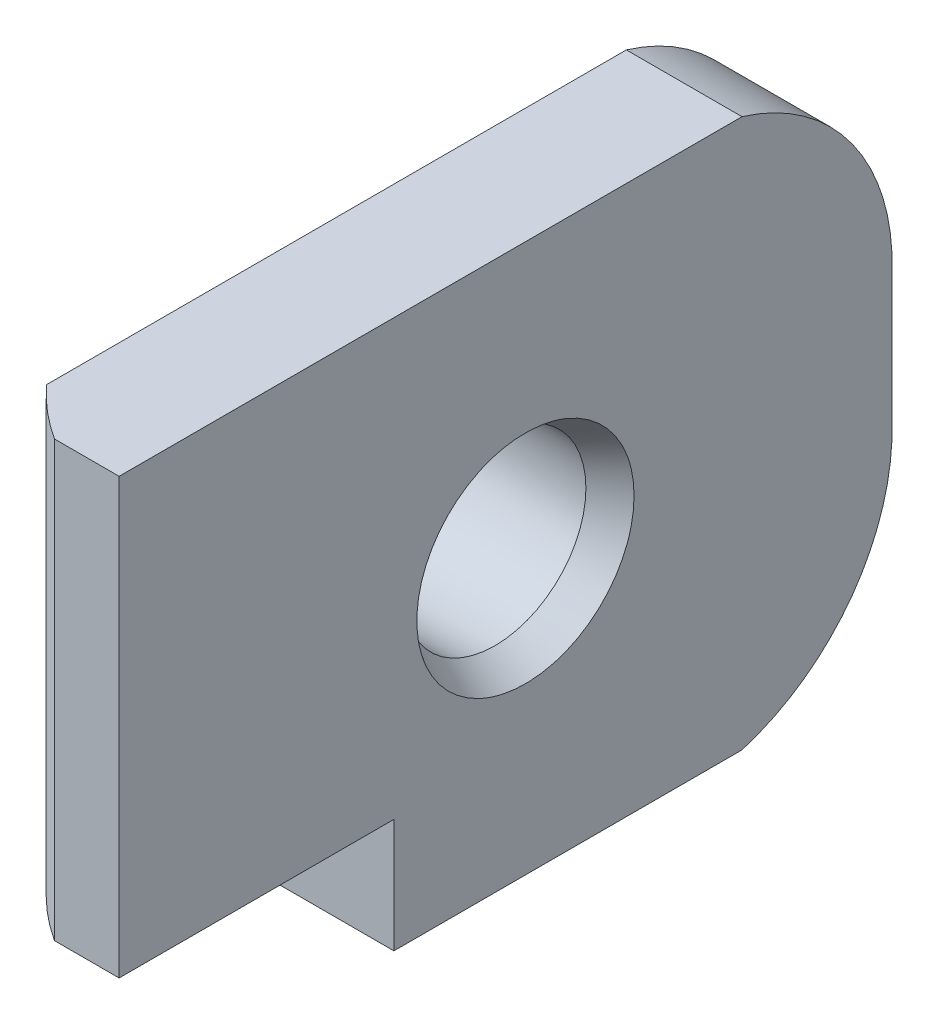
ISO-10303-21;
HEADER;
FILE_DESCRIPTION(('STEP AP214'),'2;1');
FILE_NAME('part.step','',(''),(''),'','','');
FILE_SCHEMA(('AUTOMOTIVE_DESIGN { 1 0 10303 214 1 1 1 1 }'));
ENDSEC;
DATA;
#1=APPLICATION_CONTEXT('core data for automotive mechanical design processes');
#2=APPLICATION_PROTOCOL_DEFINITION('international standard','automotive_design',2000,#1);
#3=PRODUCT_CONTEXT('',#1,'mechanical');
#4=PRODUCT('Part','Part','',(#3));
#5=PRODUCT_RELATED_PRODUCT_CATEGORY('part','',(#4));
#6=PRODUCT_DEFINITION_FORMATION('','',#4);
#7=PRODUCT_DEFINITION_CONTEXT('part definition',#1,'design');
#8=PRODUCT_DEFINITION('design','',#6,#7);
#9=PRODUCT_DEFINITION_SHAPE('','',#8);
#10=(LENGTH_UNIT() NAMED_UNIT(*) SI_UNIT(.MILLI.,.METRE.));
#11=(NAMED_UNIT(*) PLANE_ANGLE_UNIT() SI_UNIT($,.RADIAN.));
#12=(NAMED_UNIT(*) SI_UNIT($,.STERADIAN.) SOLID_ANGLE_UNIT());
#13=UNCERTAINTY_MEASURE_WITH_UNIT(LENGTH_MEASURE(1.E-05),#10,'distance_accuracy_value','');
#14=(GEOMETRIC_REPRESENTATION_CONTEXT(3) GLOBAL_UNCERTAINTY_ASSIGNED_CONTEXT((#13)) GLOBAL_UNIT_ASSIGNED_CONTEXT((#10,
#11,#12)) REPRESENTATION_CONTEXT('',''));
#15=CARTESIAN_POINT('',(0.,0.,0.));
#16=DIRECTION('',(0.,0.,1.));
#17=DIRECTION('',(1.,0.,0.));
#18=AXIS2_PLACEMENT_3D('',#15,#16,#17);
#19=CARTESIAN_POINT('',(-3.4544,9.652,16.7132));
#20=DIRECTION('',(1.,0.,0.));
#21=DIRECTION('',(0.,0.,-1.));
#22=AXIS2_PLACEMENT_3D('',#19,#20,#21);
#23=PLANE('',#22);
#24=CARTESIAN_POINT('',(-3.4544,5.9309,7.9248));
#25=DIRECTION('',(-1.,0.,0.));
#26=DIRECTION('',(0.,-1.,0.));
#27=AXIS2_PLACEMENT_3D('',#24,#25,#26);
#28=CIRCLE('',#27,1.9685);
#29=CARTESIAN_POINT('',(-3.4544,3.9624,7.9248));
#30=VERTEX_POINT('',#29);
#31=EDGE_CURVE('E480',#30,#30,#28,.T.);
#32=ORIENTED_EDGE('',*,*,#31,.F.);
#33=EDGE_LOOP('',(#32));
#34=FACE_BOUND('',#33,.T.);
#35=DIRECTION('',(0.,0.,1.));
#36=VECTOR('',#35,1.);
#37=CARTESIAN_POINT('',(-3.4544,2.4638,10.7696));
#38=LINE('',#37,#36);
#39=CARTESIAN_POINT('',(-3.4544,2.4638,10.7696));
#40=VERTEX_POINT('',#39);
#41=CARTESIAN_POINT('',(-3.4544,2.4638,14.3421484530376));
#42=VERTEX_POINT('',#41);
#43=EDGE_CURVE('E490',#40,#42,#38,.T.);
#44=ORIENTED_EDGE('',*,*,#43,.T.);
#45=DIRECTION('',(0.,-1.,0.));
#46=VECTOR('',#45,1.);
#47=CARTESIAN_POINT('',(-3.45440000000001,11.8618,14.3421484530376));
#48=LINE('',#47,#46);
#49=CARTESIAN_POINT('',(-3.45440000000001,9.652,14.3421484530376));
#50=VERTEX_POINT('',#49);
#51=EDGE_CURVE('E168',#50,#42,#48,.T.);
#52=ORIENTED_EDGE('',*,*,#51,.F.);
#53=DIRECTION('',(0.,0.,-1.));
#54=VECTOR('',#53,1.);
#55=CARTESIAN_POINT('',(-3.4544,9.652,16.7132));
#56=LINE('',#55,#54);
#57=CARTESIAN_POINT('',(-3.45440000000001,9.652,0.539561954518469));
#58=VERTEX_POINT('',#57);
#59=EDGE_CURVE('E315',#50,#58,#56,.T.);
#60=ORIENTED_EDGE('',*,*,#59,.T.);
#61=CARTESIAN_POINT('',(-3.45440000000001,7.48620047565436,4.56603639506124));
#62=DIRECTION('',(1.,0.,0.));
#63=DIRECTION('',(0.,1.,0.));
#64=AXIS2_PLACEMENT_3D('',#61,#62,#63);
#65=CIRCLE('',#64,4.572);
#66=CARTESIAN_POINT('',(-3.45440000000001,7.71964348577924,0.));
#67=VERTEX_POINT('',#66);
#68=EDGE_CURVE('E478',#67,#58,#65,.T.);
#69=ORIENTED_EDGE('',*,*,#68,.F.);
#70=DIRECTION('',(0.,-1.,0.));
#71=VECTOR('',#70,1.);
#72=CARTESIAN_POINT('',(-3.4544,9.652,0.));
#73=LINE('',#72,#71);
#74=CARTESIAN_POINT('',(-3.4544,4.14215651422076,0.));
#75=VERTEX_POINT('',#74);
#76=EDGE_CURVE('E298',#67,#75,#73,.T.);
#77=ORIENTED_EDGE('',*,*,#76,.T.);
#78=CARTESIAN_POINT('',(-3.4544,4.37559952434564,4.56603639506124));
#79=DIRECTION('',(1.,0.,0.));
#80=DIRECTION('',(0.,1.,0.));
#81=AXIS2_PLACEMENT_3D('',#78,#79,#80);
#82=CIRCLE('',#81,4.572);
#83=CARTESIAN_POINT('',(-3.4544,2.2098,0.53956195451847));
#84=VERTEX_POINT('',#83);
#85=EDGE_CURVE('E476',#84,#75,#82,.T.);
#86=ORIENTED_EDGE('',*,*,#85,.F.);
#87=DIRECTION('',(0.,0.,-1.));
#88=VECTOR('',#87,1.);
#89=CARTESIAN_POINT('',(-3.4544,2.2098,16.7132));
#90=LINE('',#89,#88);
#91=CARTESIAN_POINT('',(-3.4544,2.2098,10.7696));
#92=VERTEX_POINT('',#91);
#93=EDGE_CURVE('E313',#92,#84,#90,.T.);
#94=ORIENTED_EDGE('',*,*,#93,.F.);
#95=DIRECTION('',(0.,1.,0.));
#96=VECTOR('',#95,1.);
#97=CARTESIAN_POINT('',(-3.4544,0.,10.7696));
#98=LINE('',#97,#96);
#99=EDGE_CURVE('E493',#92,#40,#98,.T.);
#100=ORIENTED_EDGE('',*,*,#99,.T.);
#101=EDGE_LOOP('',(#44,#52,#60,#69,#77,#86,#94,#100));
#102=FACE_BOUND('',#101,.T.);
#103=ADVANCED_FACE('F151',(#34,#102),#23,.F.);
#104=CARTESIAN_POINT('',(-2.5019,0.,16.7132));
#105=DIRECTION('',(0.,1.,0.));
#106=DIRECTION('',(0.,0.,1.));
#107=AXIS2_PLACEMENT_3D('',#104,#105,#106);
#108=PLANE('',#107);
#109=DIRECTION('',(-1.,0.,0.));
#110=VECTOR('',#109,1.);
#111=CARTESIAN_POINT('',(0.,0.,10.7696));
#112=LINE('',#111,#110);
#113=CARTESIAN_POINT('',(0.,0.,10.7696));
#114=VERTEX_POINT('',#113);
#115=CARTESIAN_POINT('',(-2.5019,0.,10.7696));
#116=VERTEX_POINT('',#115);
#117=EDGE_CURVE('E501',#114,#116,#112,.T.);
#118=ORIENTED_EDGE('',*,*,#117,.T.);
#119=DIRECTION('',(0.,0.,-1.));
#120=VECTOR('',#119,1.);
#121=CARTESIAN_POINT('',(-2.5019,0.,16.7132));
#122=LINE('',#121,#120);
#123=CARTESIAN_POINT('',(-2.5019,0.,3.24039964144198));
#124=VERTEX_POINT('',#123);
#125=EDGE_CURVE('E294',#116,#124,#122,.T.);
#126=ORIENTED_EDGE('',*,*,#125,.T.);
#127=DIRECTION('',(-1.,0.,0.));
#128=VECTOR('',#127,1.);
#129=CARTESIAN_POINT('',(0.,0.,3.24039964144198));
#130=LINE('',#129,#128);
#131=CARTESIAN_POINT('',(0.,0.,3.24039964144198));
#132=VERTEX_POINT('',#131);
#133=EDGE_CURVE('E452',#132,#124,#130,.T.);
#134=ORIENTED_EDGE('',*,*,#133,.F.);
#135=DIRECTION('',(0.,0.,-1.));
#136=VECTOR('',#135,1.);
#137=CARTESIAN_POINT('',(0.,0.,16.7132));
#138=LINE('',#137,#136);
#139=EDGE_CURVE('E326',#114,#132,#138,.T.);
#140=ORIENTED_EDGE('',*,*,#139,.F.);
#141=EDGE_LOOP('',(#118,#126,#134,#140));
#142=FACE_BOUND('',#141,.T.);
#143=ADVANCED_FACE('F153',(#142),#108,.F.);
#144=CARTESIAN_POINT('',(0.,0.,16.7132));
#145=DIRECTION('',(-1.,0.,0.));
#146=DIRECTION('',(0.,0.,1.));
#147=AXIS2_PLACEMENT_3D('',#144,#145,#146);
#148=PLANE('',#147);
#149=CARTESIAN_POINT('',(0.,5.9309,7.9248));
#150=DIRECTION('',(1.,0.,0.));
#151=DIRECTION('',(0.,0.,-1.));
#152=AXIS2_PLACEMENT_3D('',#149,#150,#151);
#153=CIRCLE('',#152,2.34978211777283);
#154=CARTESIAN_POINT('',(0.,5.9309,5.57501788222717));
#155=VERTEX_POINT('',#154);
#156=EDGE_CURVE('E288',#155,#155,#153,.T.);
#157=ORIENTED_EDGE('',*,*,#156,.F.);
#158=EDGE_LOOP('',(#157));
#159=FACE_BOUND('',#158,.T.);
#160=DIRECTION('',(0.,0.,1.));
#161=VECTOR('',#160,1.);
#162=CARTESIAN_POINT('',(0.,2.4638,10.7696));
#163=LINE('',#162,#161);
#164=CARTESIAN_POINT('',(0.,2.4638,10.7696));
#165=VERTEX_POINT('',#164);
#166=CARTESIAN_POINT('',(0.,2.4638,16.7132));
#167=VERTEX_POINT('',#166);
#168=EDGE_CURVE('E176',#165,#167,#163,.T.);
#169=ORIENTED_EDGE('',*,*,#168,.F.);
#170=DIRECTION('',(0.,1.,0.));
#171=VECTOR('',#170,1.);
#172=CARTESIAN_POINT('',(0.,0.,10.7696));
#173=LINE('',#172,#171);
#174=EDGE_CURVE('E497',#114,#165,#173,.T.);
#175=ORIENTED_EDGE('',*,*,#174,.F.);
#176=ORIENTED_EDGE('',*,*,#139,.T.);
#177=CARTESIAN_POINT('',(0.,4.37559952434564,4.56603639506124));
#178=DIRECTION('',(1.,0.,0.));
#179=DIRECTION('',(0.,1.,0.));
#180=AXIS2_PLACEMENT_3D('',#177,#178,#179);
#181=CIRCLE('',#180,4.572);
#182=CARTESIAN_POINT('',(0.,4.14215651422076,0.));
#183=VERTEX_POINT('',#182);
#184=EDGE_CURVE('E453',#132,#183,#181,.T.);
#185=ORIENTED_EDGE('',*,*,#184,.T.);
#186=DIRECTION('',(0.,1.,0.));
#187=VECTOR('',#186,1.);
#188=CARTESIAN_POINT('',(0.,0.,0.));
#189=LINE('',#188,#187);
#190=CARTESIAN_POINT('',(0.,7.71964348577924,0.));
#191=VERTEX_POINT('',#190);
#192=EDGE_CURVE('E302',#183,#191,#189,.T.);
#193=ORIENTED_EDGE('',*,*,#192,.T.);
#194=CARTESIAN_POINT('',(0.,7.48620047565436,4.56603639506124));
#195=DIRECTION('',(1.,0.,0.));
#196=DIRECTION('',(0.,1.,0.));
#197=AXIS2_PLACEMENT_3D('',#194,#195,#196);
#198=CIRCLE('',#197,4.572);
#199=CARTESIAN_POINT('',(0.,11.8618,3.24039964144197));
#200=VERTEX_POINT('',#199);
#201=EDGE_CURVE('E459',#191,#200,#198,.T.);
#202=ORIENTED_EDGE('',*,*,#201,.T.);
#203=DIRECTION('',(0.,0.,-1.));
#204=VECTOR('',#203,1.);
#205=CARTESIAN_POINT('',(0.,11.8618,16.7132));
#206=LINE('',#205,#204);
#207=CARTESIAN_POINT('',(0.,11.8618,16.7132));
#208=VERTEX_POINT('',#207);
#209=EDGE_CURVE('E324',#208,#200,#206,.T.);
#210=ORIENTED_EDGE('',*,*,#209,.F.);
#211=DIRECTION('',(0.,1.,0.));
#212=VECTOR('',#211,1.);
#213=CARTESIAN_POINT('',(0.,0.,16.7132));
#214=LINE('',#213,#212);
#215=EDGE_CURVE('E292',#167,#208,#214,.T.);
#216=ORIENTED_EDGE('',*,*,#215,.F.);
#217=EDGE_LOOP('',(#169,#175,#176,#185,#193,#202,#210,#216));
#218=FACE_BOUND('',#217,.T.);
#219=ADVANCED_FACE('F389',(#159,#218),#148,.F.);
#220=CARTESIAN_POINT('',(-3.2004,2.2098,16.7132));
#221=DIRECTION('',(0.,0.,-1.));
#222=DIRECTION('',(-1.,0.,0.));
#223=AXIS2_PLACEMENT_3D('',#220,#221,#222);
#224=CYLINDRICAL_SURFACE('',#223,0.254);
#225=CARTESIAN_POINT('',(-3.2004,2.2098,10.7696));
#226=DIRECTION('',(0.,0.,1.));
#227=DIRECTION('',(1.,0.,0.));
#228=AXIS2_PLACEMENT_3D('',#225,#226,#227);
#229=CIRCLE('',#228,0.254);
#230=CARTESIAN_POINT('',(-3.2004,1.9558,10.7696));
#231=VERTEX_POINT('',#230);
#232=EDGE_CURVE('E483',#92,#231,#229,.T.);
#233=ORIENTED_EDGE('',*,*,#232,.F.);
#234=ORIENTED_EDGE('',*,*,#93,.T.);
#235=CARTESIAN_POINT('',(-3.4544,2.2098,0.53956195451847));
#236=CARTESIAN_POINT('',(-3.45440468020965,2.19070710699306,0.549821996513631));
#237=CARTESIAN_POINT('',(-3.45224743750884,2.17167999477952,0.560241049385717));
#238=CARTESIAN_POINT('',(-3.44371125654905,2.13442167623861,0.580971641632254));
#239=CARTESIAN_POINT('',(-3.43731350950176,2.1161944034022,0.591282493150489));
#240=CARTESIAN_POINT('',(-3.42169849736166,2.0840555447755,0.609737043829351));
#241=CARTESIAN_POINT('',(-3.41306472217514,2.06991096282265,0.617970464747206));
#242=CARTESIAN_POINT('',(-3.39296017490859,2.04332848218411,0.633615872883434));
#243=CARTESIAN_POINT('',(-3.38149839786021,2.03088536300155,0.641030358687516));
#244=CARTESIAN_POINT('',(-3.35888222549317,2.01087288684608,0.65306360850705));
#245=CARTESIAN_POINT('',(-3.34826777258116,2.00284155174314,0.65793262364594));
#246=CARTESIAN_POINT('',(-3.32561931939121,1.98840410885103,0.666734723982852));
#247=CARTESIAN_POINT('',(-3.31358507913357,1.98199827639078,0.670667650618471));
#248=CARTESIAN_POINT('',(-3.28827845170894,1.97108541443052,0.677394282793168));
#249=CARTESIAN_POINT('',(-3.27499825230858,1.96659149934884,0.680180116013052));
#250=CARTESIAN_POINT('',(-3.24769311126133,1.95984878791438,0.684368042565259));
#251=CARTESIAN_POINT('',(-3.23367025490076,1.95759402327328,0.685773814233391));
#252=CARTESIAN_POINT('',(-3.2131727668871,1.95603917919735,0.686743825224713));
#253=CARTESIAN_POINT('',(-3.20678458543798,1.95579632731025,0.686895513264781));
#254=CARTESIAN_POINT('',(-3.2004,1.9558,0.686892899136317));
#255=B_SPLINE_CURVE_WITH_KNOTS('',3,(#235,#236,#237,#238,#239,#240,#241,#242,#243,#244,#245,
#246,#247,#248,#249,#250,#251,#252,#253,#254),.UNSPECIFIED.,.F.,.F.,(4,2,2,2,2,2,2,2,2,4),(0.,
0.0649552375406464,0.130200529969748,0.18543137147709,0.240488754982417,0.282835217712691,
0.325188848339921,0.367828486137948,0.410354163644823,0.429512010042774),.UNSPECIFIED.);
#256=CARTESIAN_POINT('',(-3.2004,1.9558,0.686892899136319));
#257=VERTEX_POINT('',#256);
#258=EDGE_CURVE('E369',#84,#257,#255,.T.);
#259=ORIENTED_EDGE('',*,*,#258,.T.);
#260=DIRECTION('',(0.,0.,-1.));
#261=VECTOR('',#260,1.);
#262=CARTESIAN_POINT('',(-3.2004,1.9558,16.7132));
#263=LINE('',#262,#261);
#264=EDGE_CURVE('E311',#231,#257,#263,.T.);
#265=ORIENTED_EDGE('',*,*,#264,.F.);
#266=EDGE_LOOP('',(#233,#234,#259,#265));
#267=FACE_BOUND('',#266,.T.);
#268=ADVANCED_FACE('F383',(#267),#224,.T.);
#269=CARTESIAN_POINT('',(-3.2004,1.9558,16.7132));
#270=DIRECTION('',(0.,1.,0.));
#271=DIRECTION('',(0.,0.,1.));
#272=AXIS2_PLACEMENT_3D('',#269,#270,#271);
#273=PLANE('',#272);
#274=DIRECTION('',(1.,0.,0.));
#275=VECTOR('',#274,1.);
#276=CARTESIAN_POINT('',(-3.2004,1.9558,10.7696));
#277=LINE('',#276,#275);
#278=CARTESIAN_POINT('',(-2.7559,1.9558,10.7696));
#279=VERTEX_POINT('',#278);
#280=EDGE_CURVE('E485',#231,#279,#277,.T.);
#281=ORIENTED_EDGE('',*,*,#280,.F.);
#282=ORIENTED_EDGE('',*,*,#264,.T.);
#283=DIRECTION('',(-1.,0.,0.));
#284=VECTOR('',#283,1.);
#285=CARTESIAN_POINT('',(0.,1.9558,0.686892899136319));
#286=LINE('',#285,#284);
#287=CARTESIAN_POINT('',(-2.7559,1.9558,0.686892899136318));
#288=VERTEX_POINT('',#287);
#289=EDGE_CURVE('E377',#257,#288,#286,.F.);
#290=ORIENTED_EDGE('',*,*,#289,.T.);
#291=DIRECTION('',(0.,0.,-1.));
#292=VECTOR('',#291,1.);
#293=CARTESIAN_POINT('',(-2.7559,1.9558,16.7132));
#294=LINE('',#293,#292);
#295=EDGE_CURVE('E309',#279,#288,#294,.T.);
#296=ORIENTED_EDGE('',*,*,#295,.F.);
#297=EDGE_LOOP('',(#281,#282,#290,#296));
#298=FACE_BOUND('',#297,.T.);
#299=ADVANCED_FACE('F388',(#298),#273,.F.);
#300=CARTESIAN_POINT('',(-2.7559,1.7018,16.7132));
#301=DIRECTION('',(0.,0.,-1.));
#302=DIRECTION('',(-1.,0.,0.));
#303=AXIS2_PLACEMENT_3D('',#300,#301,#302);
#304=CYLINDRICAL_SURFACE('',#303,0.254);
#305=DIRECTION('',(0.,0.,-1.));
#306=VECTOR('',#305,1.);
#307=CARTESIAN_POINT('',(-2.5019,1.7018,16.7132));
#308=LINE('',#307,#306);
#309=CARTESIAN_POINT('',(-2.5019,1.7018,10.7696));
#310=VERTEX_POINT('',#309);
#311=CARTESIAN_POINT('',(-2.5019,1.7018,0.857400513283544));
#312=VERTEX_POINT('',#311);
#313=EDGE_CURVE('E296',#310,#312,#308,.T.);
#314=ORIENTED_EDGE('',*,*,#313,.F.);
#315=CARTESIAN_POINT('',(-2.7559,1.7018,10.7696));
#316=DIRECTION('',(0.,0.,1.));
#317=DIRECTION('',(1.,0.,0.));
#318=AXIS2_PLACEMENT_3D('',#315,#316,#317);
#319=CIRCLE('',#318,0.254);
#320=EDGE_CURVE('E487',#310,#279,#319,.T.);
#321=ORIENTED_EDGE('',*,*,#320,.T.);
#322=ORIENTED_EDGE('',*,*,#295,.T.);
#323=CARTESIAN_POINT('',(-2.5019,1.7018,0.857400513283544));
#324=CARTESIAN_POINT('',(-2.50189749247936,1.71924169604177,0.844816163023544));
#325=CARTESIAN_POINT('',(-2.50369926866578,1.73682990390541,0.832331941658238));
#326=CARTESIAN_POINT('',(-2.51106362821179,1.77173737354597,0.807908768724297));
#327=CARTESIAN_POINT('',(-2.51664755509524,1.78905453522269,0.7959733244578));
#328=CARTESIAN_POINT('',(-2.53010616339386,1.81902470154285,0.775605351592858));
#329=CARTESIAN_POINT('',(-2.53722778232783,1.83187856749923,0.766972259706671));
#330=CARTESIAN_POINT('',(-2.55389898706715,1.85649860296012,0.750603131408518));
#331=CARTESIAN_POINT('',(-2.56344157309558,1.86826777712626,0.74286460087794));
#332=CARTESIAN_POINT('',(-2.58327410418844,1.88857835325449,0.729627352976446));
#333=CARTESIAN_POINT('',(-2.59323141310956,1.89733859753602,0.723966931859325));
#334=CARTESIAN_POINT('',(-2.61474760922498,1.91339382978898,0.713658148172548));
#335=CARTESIAN_POINT('',(-2.62630697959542,1.92068837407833,0.709010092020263));
#336=CARTESIAN_POINT('',(-2.65087034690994,1.93348482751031,0.700895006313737));
#337=CARTESIAN_POINT('',(-2.66388333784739,1.93897464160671,0.697435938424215));
#338=CARTESIAN_POINT('',(-2.69090269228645,1.94775123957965,0.691921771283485));
#339=CARTESIAN_POINT('',(-2.70490699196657,1.9510424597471,0.689863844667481));
#340=CARTESIAN_POINT('',(-2.72521023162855,1.95401445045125,0.688007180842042));
#341=CARTESIAN_POINT('',(-2.73132487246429,1.95468337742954,0.687589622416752));
#342=CARTESIAN_POINT('',(-2.74359174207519,1.95557589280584,0.687032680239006));
#343=CARTESIAN_POINT('',(-2.74974391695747,1.95580001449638,0.686892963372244));
#344=CARTESIAN_POINT('',(-2.75589999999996,1.9558000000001,0.686892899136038));
#345=B_SPLINE_CURVE_WITH_KNOTS('',3,(#323,#324,#325,#326,#327,#328,#329,#330,#331,#332,#333,
#334,#335,#336,#337,#338,#339,#340,#341,#342,#343,#344),.UNSPECIFIED.,.F.,.F.,(4,2,2,2,2,2,2,2,
2,2,4),(0.,0.0645484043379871,0.129464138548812,0.180389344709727,0.231168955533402,
0.274250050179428,0.317344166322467,0.360721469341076,0.404010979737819,0.422488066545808,
0.440942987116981),.UNSPECIFIED.);
#346=EDGE_CURVE('E361',#312,#288,#345,.T.);
#347=ORIENTED_EDGE('',*,*,#346,.F.);
#348=EDGE_LOOP('',(#314,#321,#322,#347));
#349=FACE_BOUND('',#348,.T.);
#350=ADVANCED_FACE('F619',(#349),#304,.F.);
#351=CARTESIAN_POINT('',(-2.5019,1.7018,16.7132));
#352=DIRECTION('',(1.,0.,0.));
#353=DIRECTION('',(0.,1.,0.));
#354=AXIS2_PLACEMENT_3D('',#351,#352,#353);
#355=PLANE('',#354);
#356=DIRECTION('',(0.,-1.,0.));
#357=VECTOR('',#356,1.);
#358=CARTESIAN_POINT('',(-2.5019,1.7018,10.7696));
#359=LINE('',#358,#357);
#360=EDGE_CURVE('E161',#310,#116,#359,.T.);
#361=ORIENTED_EDGE('',*,*,#360,.F.);
#362=ORIENTED_EDGE('',*,*,#313,.T.);
#363=CARTESIAN_POINT('',(-2.5019,4.37559952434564,4.56603639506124));
#364=DIRECTION('',(1.,0.,0.));
#365=DIRECTION('',(0.,1.,0.));
#366=AXIS2_PLACEMENT_3D('',#363,#364,#365);
#367=CIRCLE('',#366,4.572);
#368=EDGE_CURVE('E462',#312,#124,#367,.F.);
#369=ORIENTED_EDGE('',*,*,#368,.T.);
#370=ORIENTED_EDGE('',*,*,#125,.F.);
#371=EDGE_LOOP('',(#361,#362,#369,#370));
#372=FACE_BOUND('',#371,.T.);
#373=ADVANCED_FACE('F614',(#372),#355,.F.);
#374=CARTESIAN_POINT('',(-2.7559,10.16,16.7132));
#375=DIRECTION('',(0.,0.,-1.));
#376=DIRECTION('',(-1.,0.,0.));
#377=AXIS2_PLACEMENT_3D('',#374,#375,#376);
#378=PLANE('',#377);
#379=DIRECTION('',(-1.,0.,0.));
#380=VECTOR('',#379,1.);
#381=CARTESIAN_POINT('',(0.,11.8618,16.7132));
#382=LINE('',#381,#380);
#383=CARTESIAN_POINT('',(-1.39849374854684,11.8618,16.7132));
#384=VERTEX_POINT('',#383);
#385=EDGE_CURVE('E285',#208,#384,#382,.T.);
#386=ORIENTED_EDGE('',*,*,#385,.T.);
#387=DIRECTION('',(0.,-1.,0.));
#388=VECTOR('',#387,1.);
#389=CARTESIAN_POINT('',(-1.39849374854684,11.8618,16.7132));
#390=LINE('',#389,#388);
#391=CARTESIAN_POINT('',(-1.39849374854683,2.4638,16.7132));
#392=VERTEX_POINT('',#391);
#393=EDGE_CURVE('E272',#384,#392,#390,.T.);
#394=ORIENTED_EDGE('',*,*,#393,.T.);
#395=DIRECTION('',(-1.,0.,0.));
#396=VECTOR('',#395,1.);
#397=CARTESIAN_POINT('',(0.,2.4638,16.7132));
#398=LINE('',#397,#396);
#399=EDGE_CURVE('E503',#167,#392,#398,.T.);
#400=ORIENTED_EDGE('',*,*,#399,.F.);
#401=ORIENTED_EDGE('',*,*,#215,.T.);
#402=EDGE_LOOP('',(#386,#394,#400,#401));
#403=FACE_BOUND('',#402,.T.);
#404=ADVANCED_FACE('F290',(#403),#378,.F.);
#405=CARTESIAN_POINT('',(0.,11.8618,16.7132));
#406=DIRECTION('',(0.,-1.,0.));
#407=DIRECTION('',(0.,0.,-1.));
#408=AXIS2_PLACEMENT_3D('',#405,#406,#407);
#409=PLANE('',#408);
#410=DIRECTION('',(0.,0.,-1.));
#411=VECTOR('',#410,1.);
#412=CARTESIAN_POINT('',(-2.5019,11.8618,16.7132));
#413=LINE('',#412,#411);
#414=CARTESIAN_POINT('',(-2.5019,11.8618,15.7810936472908));
#415=VERTEX_POINT('',#414);
#416=CARTESIAN_POINT('',(-2.5019,11.8618,3.24039964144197));
#417=VERTEX_POINT('',#416);
#418=EDGE_CURVE('E287',#415,#417,#413,.T.);
#419=ORIENTED_EDGE('',*,*,#418,.F.);
#420=CARTESIAN_POINT('',(1.62559999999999,11.8618,12.0142));
#421=DIRECTION('',(0.,1.,0.));
#422=DIRECTION('',(-1.,0.,0.));
#423=AXIS2_PLACEMENT_3D('',#420,#421,#422);
#424=CIRCLE('',#423,5.588);
#425=EDGE_CURVE('E275',#415,#384,#424,.T.);
#426=ORIENTED_EDGE('',*,*,#425,.T.);
#427=ORIENTED_EDGE('',*,*,#385,.F.);
#428=ORIENTED_EDGE('',*,*,#209,.T.);
#429=DIRECTION('',(-1.,0.,0.));
#430=VECTOR('',#429,1.);
#431=CARTESIAN_POINT('',(0.,11.8618,3.24039964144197));
#432=LINE('',#431,#430);
#433=EDGE_CURVE('E449',#200,#417,#432,.T.);
#434=ORIENTED_EDGE('',*,*,#433,.T.);
#435=EDGE_LOOP('',(#419,#426,#427,#428,#434));
#436=FACE_BOUND('',#435,.T.);
#437=ADVANCED_FACE('F283',(#436),#409,.F.);
#438=CARTESIAN_POINT('',(-2.5019,11.8618,16.7132));
#439=DIRECTION('',(1.,0.,0.));
#440=DIRECTION('',(0.,1.,0.));
#441=AXIS2_PLACEMENT_3D('',#438,#439,#440);
#442=PLANE('',#441);
#443=DIRECTION('',(0.,0.,-1.));
#444=VECTOR('',#443,1.);
#445=CARTESIAN_POINT('',(-2.5019,10.16,16.7132));
#446=LINE('',#445,#444);
#447=CARTESIAN_POINT('',(-2.5019,10.16,15.7810936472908));
#448=VERTEX_POINT('',#447);
#449=CARTESIAN_POINT('',(-2.5019,10.16,0.857400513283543));
#450=VERTEX_POINT('',#449);
#451=EDGE_CURVE('E321',#448,#450,#446,.T.);
#452=ORIENTED_EDGE('',*,*,#451,.F.);
#453=DIRECTION('',(0.,-1.,0.));
#454=VECTOR('',#453,1.);
#455=CARTESIAN_POINT('',(-2.5019,11.8618,15.7810936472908));
#456=LINE('',#455,#454);
#457=EDGE_CURVE('E426',#448,#415,#456,.F.);
#458=ORIENTED_EDGE('',*,*,#457,.T.);
#459=ORIENTED_EDGE('',*,*,#418,.T.);
#460=CARTESIAN_POINT('',(-2.5019,7.48620047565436,4.56603639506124));
#461=DIRECTION('',(1.,0.,0.));
#462=DIRECTION('',(0.,1.,0.));
#463=AXIS2_PLACEMENT_3D('',#460,#461,#462);
#464=CIRCLE('',#463,4.572);
#465=EDGE_CURVE('E305',#417,#450,#464,.F.);
#466=ORIENTED_EDGE('',*,*,#465,.T.);
#467=EDGE_LOOP('',(#452,#458,#459,#466));
#468=FACE_BOUND('',#467,.T.);
#469=ADVANCED_FACE('F432',(#468),#442,.F.);
#470=CARTESIAN_POINT('',(-2.7559,10.16,16.7132));
#471=DIRECTION('',(0.,0.,-1.));
#472=DIRECTION('',(-1.,0.,0.));
#473=AXIS2_PLACEMENT_3D('',#470,#471,#472);
#474=CYLINDRICAL_SURFACE('',#473,0.254);
#475=DIRECTION('',(0.,0.,-1.));
#476=VECTOR('',#475,1.);
#477=CARTESIAN_POINT('',(-2.7559,9.906,16.7132));
#478=LINE('',#477,#476);
#479=CARTESIAN_POINT('',(-2.7559,9.906,15.482369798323));
#480=VERTEX_POINT('',#479);
#481=CARTESIAN_POINT('',(-2.7559,9.906,0.686892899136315));
#482=VERTEX_POINT('',#481);
#483=EDGE_CURVE('E319',#480,#482,#478,.T.);
#484=ORIENTED_EDGE('',*,*,#483,.F.);
#485=CARTESIAN_POINT('',(-2.7559,9.906,15.482369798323));
#486=CARTESIAN_POINT('',(-2.74534437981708,9.9060056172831,15.4957065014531));
#487=CARTESIAN_POINT('',(-2.73472187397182,9.90665864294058,15.5090000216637));
#488=CARTESIAN_POINT('',(-2.71339241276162,9.90934915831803,15.5354463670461));
#489=CARTESIAN_POINT('',(-2.70268529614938,9.91139105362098,15.5485986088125));
#490=CARTESIAN_POINT('',(-2.68116333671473,9.91698666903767,15.5747933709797));
#491=CARTESIAN_POINT('',(-2.67034893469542,9.92055996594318,15.5878321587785));
#492=CARTESIAN_POINT('',(-2.6488947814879,9.92934847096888,15.6134661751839));
#493=CARTESIAN_POINT('',(-2.63825479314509,9.9345612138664,15.6260620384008));
#494=CARTESIAN_POINT('',(-2.61679252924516,9.9470982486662,15.6512505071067));
#495=CARTESIAN_POINT('',(-2.60598681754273,9.95451339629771,15.6638127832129));
#496=CARTESIAN_POINT('',(-2.58506851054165,9.97154897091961,15.687926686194));
#497=CARTESIAN_POINT('',(-2.57495362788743,9.98116161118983,15.699481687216));
#498=CARTESIAN_POINT('',(-2.55783722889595,10.0005704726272,15.7188900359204));
#499=CARTESIAN_POINT('',(-2.55062655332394,10.0099095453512,15.7270125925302));
#500=CARTESIAN_POINT('',(-2.53723321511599,10.0301999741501,15.7420230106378));
#501=CARTESIAN_POINT('',(-2.5310494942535,10.041149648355,15.748912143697));
#502=CARTESIAN_POINT('',(-2.52141451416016,10.0618629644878,15.7596043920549));
#503=CARTESIAN_POINT('',(-2.51766234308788,10.0713073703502,15.7637525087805));
#504=CARTESIAN_POINT('',(-2.51124068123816,10.0909760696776,15.7708362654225));
#505=CARTESIAN_POINT('',(-2.50856867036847,10.1011984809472,15.7737747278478));
#506=CARTESIAN_POINT('',(-2.50501997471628,10.1195195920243,15.7776728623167));
#507=CARTESIAN_POINT('',(-2.50385959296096,10.1274977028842,15.7789456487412));
#508=CARTESIAN_POINT('',(-2.50229511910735,10.1436468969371,15.7806607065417));
#509=CARTESIAN_POINT('',(-2.50189404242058,10.1518186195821,15.7810996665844));
#510=CARTESIAN_POINT('',(-2.5019,10.16,15.7810936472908));
#511=B_SPLINE_CURVE_WITH_KNOTS('',3,(#485,#486,#487,#488,#489,#490,#491,#492,#493,#494,#495,
#496,#497,#498,#499,#500,#501,#502,#503,#504,#505,#506,#507,#508,#509,#510),.UNSPECIFIED.,.F.,
.F.,(4,2,2,2,2,2,2,2,2,2,2,2,4),(0.,0.0510246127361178,0.10221183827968,0.154073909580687,
0.205858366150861,0.260177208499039,0.314306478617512,0.357137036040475,0.39992318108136,
0.432727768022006,0.46545537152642,0.489864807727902,0.514370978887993),.UNSPECIFIED.);
#512=EDGE_CURVE('E420',#480,#448,#511,.T.);
#513=ORIENTED_EDGE('',*,*,#512,.T.);
#514=ORIENTED_EDGE('',*,*,#451,.T.);
#515=CARTESIAN_POINT('',(-2.5019,10.16,0.857400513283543));
#516=CARTESIAN_POINT('',(-2.50189749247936,10.1425583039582,0.844816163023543));
#517=CARTESIAN_POINT('',(-2.50369926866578,10.1249700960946,0.832331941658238));
#518=CARTESIAN_POINT('',(-2.51106362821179,10.090062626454,0.807908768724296));
#519=CARTESIAN_POINT('',(-2.51664755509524,10.0727454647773,0.795973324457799));
#520=CARTESIAN_POINT('',(-2.53010616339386,10.0427752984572,0.775605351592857));
#521=CARTESIAN_POINT('',(-2.53722778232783,10.0299214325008,0.766972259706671));
#522=CARTESIAN_POINT('',(-2.55389898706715,10.0053013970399,0.750603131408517));
#523=CARTESIAN_POINT('',(-2.56344157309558,9.99353222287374,0.742864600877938));
#524=CARTESIAN_POINT('',(-2.58327410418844,9.97322164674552,0.729627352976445));
#525=CARTESIAN_POINT('',(-2.59323141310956,9.96446140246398,0.723966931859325));
#526=CARTESIAN_POINT('',(-2.61474760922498,9.94840617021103,0.713658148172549));
#527=CARTESIAN_POINT('',(-2.62630697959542,9.94111162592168,0.709010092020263));
#528=CARTESIAN_POINT('',(-2.65087034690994,9.92831517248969,0.700895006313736));
#529=CARTESIAN_POINT('',(-2.66388333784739,9.92282535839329,0.697435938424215));
#530=CARTESIAN_POINT('',(-2.69090269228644,9.91404876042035,0.691921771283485));
#531=CARTESIAN_POINT('',(-2.70490699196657,9.9107575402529,0.689863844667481));
#532=CARTESIAN_POINT('',(-2.72521023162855,9.90778554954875,0.688007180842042));
#533=CARTESIAN_POINT('',(-2.73132487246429,9.90711662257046,0.687589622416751));
#534=CARTESIAN_POINT('',(-2.74359174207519,9.90622410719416,0.687032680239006));
#535=CARTESIAN_POINT('',(-2.74974391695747,9.90599998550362,0.686892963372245));
#536=CARTESIAN_POINT('',(-2.75589999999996,9.9059999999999,0.686892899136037));
#537=B_SPLINE_CURVE_WITH_KNOTS('',3,(#515,#516,#517,#518,#519,#520,#521,#522,#523,#524,#525,
#526,#527,#528,#529,#530,#531,#532,#533,#534,#535,#536),.UNSPECIFIED.,.F.,.F.,(4,2,2,2,2,2,2,2,
2,2,4),(0.,0.0645484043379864,0.129464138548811,0.180389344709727,0.231168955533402,
0.274250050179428,0.317344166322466,0.360721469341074,0.404010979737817,0.422488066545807,
0.440942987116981),.UNSPECIFIED.);
#538=EDGE_CURVE('E437',#450,#482,#537,.T.);
#539=ORIENTED_EDGE('',*,*,#538,.T.);
#540=EDGE_LOOP('',(#484,#513,#514,#539));
#541=FACE_BOUND('',#540,.T.);
#542=ADVANCED_FACE('F428',(#541),#474,.F.);
#543=CARTESIAN_POINT('',(-2.7559,9.906,16.7132));
#544=DIRECTION('',(0.,-1.,0.));
#545=DIRECTION('',(0.,0.,-1.));
#546=AXIS2_PLACEMENT_3D('',#543,#544,#545);
#547=PLANE('',#546);
#548=DIRECTION('',(0.,0.,-1.));
#549=VECTOR('',#548,1.);
#550=CARTESIAN_POINT('',(-3.2004,9.906,16.7132));
#551=LINE('',#550,#549);
#552=CARTESIAN_POINT('',(-3.2004,9.906,14.831196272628));
#553=VERTEX_POINT('',#552);
#554=CARTESIAN_POINT('',(-3.2004,9.906,0.686892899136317));
#555=VERTEX_POINT('',#554);
#556=EDGE_CURVE('E317',#553,#555,#551,.T.);
#557=ORIENTED_EDGE('',*,*,#556,.F.);
#558=CARTESIAN_POINT('',(1.62559999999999,9.906,12.0142));
#559=DIRECTION('',(0.,-1.,0.));
#560=DIRECTION('',(0.,0.,-1.));
#561=AXIS2_PLACEMENT_3D('',#558,#559,#560);
#562=CIRCLE('',#561,5.588);
#563=EDGE_CURVE('E408',#553,#480,#562,.F.);
#564=ORIENTED_EDGE('',*,*,#563,.T.);
#565=ORIENTED_EDGE('',*,*,#483,.T.);
#566=DIRECTION('',(-1.,0.,0.));
#567=VECTOR('',#566,1.);
#568=CARTESIAN_POINT('',(0.,9.906,0.686892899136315));
#569=LINE('',#568,#567);
#570=EDGE_CURVE('E442',#482,#555,#569,.T.);
#571=ORIENTED_EDGE('',*,*,#570,.T.);
#572=EDGE_LOOP('',(#557,#564,#565,#571));
#573=FACE_BOUND('',#572,.T.);
#574=ADVANCED_FACE('F397',(#573),#547,.F.);
#575=CARTESIAN_POINT('',(-3.2004,9.652,16.7132));
#576=DIRECTION('',(0.,0.,-1.));
#577=DIRECTION('',(-1.,0.,0.));
#578=AXIS2_PLACEMENT_3D('',#575,#576,#577);
#579=CYLINDRICAL_SURFACE('',#578,0.254);
#580=CARTESIAN_POINT('',(-3.2004,9.906,14.831196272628));
#581=CARTESIAN_POINT('',(-3.21467350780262,9.90597554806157,14.806747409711));
#582=CARTESIAN_POINT('',(-3.22875723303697,9.90479604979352,14.7821888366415));
#583=CARTESIAN_POINT('',(-3.25650376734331,9.90013344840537,14.7329500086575));
#584=CARTESIAN_POINT('',(-3.27016511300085,9.89664311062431,14.7082696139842));
#585=CARTESIAN_POINT('',(-3.29681836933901,9.88740592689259,14.6592547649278));
#586=CARTESIAN_POINT('',(-3.3098150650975,9.88167895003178,14.6349191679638));
#587=CARTESIAN_POINT('',(-3.33515278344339,9.86779389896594,14.5866338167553));
#588=CARTESIAN_POINT('',(-3.34749482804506,9.85963975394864,14.5626835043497));
#589=CARTESIAN_POINT('',(-3.36624367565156,9.84458187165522,14.5256674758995));
#590=CARTESIAN_POINT('',(-3.37292296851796,9.83864522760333,14.5123448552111));
#591=CARTESIAN_POINT('',(-3.38600332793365,9.8256457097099,14.485999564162));
#592=CARTESIAN_POINT('',(-3.39240265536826,9.81857680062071,14.4729789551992));
#593=CARTESIAN_POINT('',(-3.40654398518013,9.80094146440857,14.4439325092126));
#594=CARTESIAN_POINT('',(-3.41415445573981,9.7899511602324,14.4280970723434));
#595=CARTESIAN_POINT('',(-3.42829384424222,9.76506831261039,14.3983483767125));
#596=CARTESIAN_POINT('',(-3.43483174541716,9.7512023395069,14.3844193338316));
#597=CARTESIAN_POINT('',(-3.44234690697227,9.72955438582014,14.3682778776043));
#598=CARTESIAN_POINT('',(-3.44422464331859,9.72347610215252,14.3642294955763));
#599=CARTESIAN_POINT('',(-3.44760002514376,9.71074975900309,14.3569337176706));
#600=CARTESIAN_POINT('',(-3.44909792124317,9.70410207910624,14.3536857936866));
#601=CARTESIAN_POINT('',(-3.45141229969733,9.69130230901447,14.3486585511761));
#602=CARTESIAN_POINT('',(-3.45229650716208,9.68522056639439,14.3467336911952));
#603=CARTESIAN_POINT('',(-3.45362375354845,9.67279354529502,14.3438421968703));
#604=CARTESIAN_POINT('',(-3.45406797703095,9.66644902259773,14.3428729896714));
#605=CARTESIAN_POINT('',(-3.45435764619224,9.65738187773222,14.3422408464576));
#606=CARTESIAN_POINT('',(-3.4544008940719,9.65469052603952,14.3421464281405));
#607=CARTESIAN_POINT('',(-3.4544,9.652,14.3421484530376));
#608=B_SPLINE_CURVE_WITH_KNOTS('',3,(#580,#581,#582,#583,#584,#585,#586,#587,#588,#589,#590,
#591,#592,#593,#594,#595,#596,#597,#598,#599,#600,#601,#602,#603,#604,#605,#606,#607),
.UNSPECIFIED.,.F.,.F.,(4,2,2,2,2,2,2,2,2,2,2,2,2,4),(0.,0.0849074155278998,0.170081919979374,
0.254516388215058,0.338814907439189,0.386908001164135,0.435266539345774,0.497289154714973,
0.558762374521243,0.581328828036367,0.603880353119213,0.623123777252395,0.642315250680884,
0.650387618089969),.UNSPECIFIED.);
#609=EDGE_CURVE('E402',#553,#50,#608,.T.);
#610=ORIENTED_EDGE('',*,*,#609,.F.);
#611=ORIENTED_EDGE('',*,*,#556,.T.);
#612=CARTESIAN_POINT('',(-3.4544,9.652,0.539561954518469));
#613=CARTESIAN_POINT('',(-3.45440468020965,9.67109289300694,0.54982199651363));
#614=CARTESIAN_POINT('',(-3.45224743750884,9.69012000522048,0.560241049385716));
#615=CARTESIAN_POINT('',(-3.44371125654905,9.72737832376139,0.580971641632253));
#616=CARTESIAN_POINT('',(-3.43731350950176,9.74560559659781,0.591282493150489));
#617=CARTESIAN_POINT('',(-3.42169849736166,9.77774445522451,0.609737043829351));
#618=CARTESIAN_POINT('',(-3.41306472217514,9.79188903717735,0.617970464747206));
#619=CARTESIAN_POINT('',(-3.39296017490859,9.81847151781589,0.633615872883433));
#620=CARTESIAN_POINT('',(-3.38149839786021,9.83091463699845,0.641030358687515));
#621=CARTESIAN_POINT('',(-3.35888222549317,9.85092711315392,0.653063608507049));
#622=CARTESIAN_POINT('',(-3.34826777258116,9.85895844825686,0.657932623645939));
#623=CARTESIAN_POINT('',(-3.32561931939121,9.87339589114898,0.666734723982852));
#624=CARTESIAN_POINT('',(-3.31358507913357,9.87980172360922,0.670667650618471));
#625=CARTESIAN_POINT('',(-3.28827845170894,9.89071458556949,0.677394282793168));
#626=CARTESIAN_POINT('',(-3.27499825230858,9.89520850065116,0.680180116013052));
#627=CARTESIAN_POINT('',(-3.24769311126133,9.90195121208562,0.684368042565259));
#628=CARTESIAN_POINT('',(-3.23367025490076,9.90420597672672,0.685773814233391));
#629=CARTESIAN_POINT('',(-3.2131727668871,9.90576082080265,0.686743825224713));
#630=CARTESIAN_POINT('',(-3.20678458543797,9.90600367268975,0.686895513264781));
#631=CARTESIAN_POINT('',(-3.2004,9.906,0.686892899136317));
#632=B_SPLINE_CURVE_WITH_KNOTS('',3,(#612,#613,#614,#615,#616,#617,#618,#619,#620,#621,#622,
#623,#624,#625,#626,#627,#628,#629,#630,#631),.UNSPECIFIED.,.F.,.F.,(4,2,2,2,2,2,2,2,2,4),(0.,
0.0649552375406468,0.130200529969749,0.185431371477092,0.240488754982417,0.282835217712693,
0.325188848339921,0.36782848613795,0.410354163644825,0.429512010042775),.UNSPECIFIED.);
#633=EDGE_CURVE('E376',#58,#555,#632,.T.);
#634=ORIENTED_EDGE('',*,*,#633,.F.);
#635=ORIENTED_EDGE('',*,*,#59,.F.);
#636=EDGE_LOOP('',(#610,#611,#634,#635));
#637=FACE_BOUND('',#636,.T.);
#638=ADVANCED_FACE('F393',(#637),#579,.T.);
#639=CARTESIAN_POINT('',(-2.7559,10.16,0.));
#640=DIRECTION('',(0.,0.,-1.));
#641=DIRECTION('',(-1.,0.,0.));
#642=AXIS2_PLACEMENT_3D('',#639,#640,#641);
#643=PLANE('',#642);
#644=DIRECTION('',(-1.,0.,0.));
#645=VECTOR('',#644,1.);
#646=CARTESIAN_POINT('',(0.,7.71964348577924,0.));
#647=LINE('',#646,#645);
#648=EDGE_CURVE('E464',#191,#67,#647,.T.);
#649=ORIENTED_EDGE('',*,*,#648,.F.);
#650=ORIENTED_EDGE('',*,*,#192,.F.);
#651=DIRECTION('',(-1.,0.,0.));
#652=VECTOR('',#651,1.);
#653=CARTESIAN_POINT('',(0.,4.14215651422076,0.));
#654=LINE('',#653,#652);
#655=EDGE_CURVE('E456',#183,#75,#654,.T.);
#656=ORIENTED_EDGE('',*,*,#655,.T.);
#657=ORIENTED_EDGE('',*,*,#76,.F.);
#658=EDGE_LOOP('',(#649,#650,#656,#657));
#659=FACE_BOUND('',#658,.T.);
#660=ADVANCED_FACE('F355',(#659),#643,.T.);
#661=CARTESIAN_POINT('',(0.,4.37559952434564,4.56603639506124));
#662=DIRECTION('',(-1.,0.,0.));
#663=DIRECTION('',(0.,-1.,0.));
#664=AXIS2_PLACEMENT_3D('',#661,#662,#663);
#665=CYLINDRICAL_SURFACE('',#664,4.572);
#666=ORIENTED_EDGE('',*,*,#85,.T.);
#667=ORIENTED_EDGE('',*,*,#655,.F.);
#668=ORIENTED_EDGE('',*,*,#184,.F.);
#669=ORIENTED_EDGE('',*,*,#133,.T.);
#670=ORIENTED_EDGE('',*,*,#368,.F.);
#671=ORIENTED_EDGE('',*,*,#346,.T.);
#672=ORIENTED_EDGE('',*,*,#289,.F.);
#673=ORIENTED_EDGE('',*,*,#258,.F.);
#674=EDGE_LOOP('',(#666,#667,#668,#669,#670,#671,#672,#673));
#675=FACE_BOUND('',#674,.T.);
#676=ADVANCED_FACE('F351',(#675),#665,.T.);
#677=CARTESIAN_POINT('',(0.,7.48620047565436,4.56603639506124));
#678=DIRECTION('',(-1.,0.,0.));
#679=DIRECTION('',(0.,-1.,0.));
#680=AXIS2_PLACEMENT_3D('',#677,#678,#679);
#681=CYLINDRICAL_SURFACE('',#680,4.572);
#682=ORIENTED_EDGE('',*,*,#433,.F.);
#683=ORIENTED_EDGE('',*,*,#201,.F.);
#684=ORIENTED_EDGE('',*,*,#648,.T.);
#685=ORIENTED_EDGE('',*,*,#68,.T.);
#686=ORIENTED_EDGE('',*,*,#633,.T.);
#687=ORIENTED_EDGE('',*,*,#570,.F.);
#688=ORIENTED_EDGE('',*,*,#538,.F.);
#689=ORIENTED_EDGE('',*,*,#465,.F.);
#690=EDGE_LOOP('',(#682,#683,#684,#685,#686,#687,#688,#689));
#691=FACE_BOUND('',#690,.T.);
#692=ADVANCED_FACE('F349',(#691),#681,.T.);
#693=CARTESIAN_POINT('',(0.,5.9309,7.9248));
#694=DIRECTION('',(-1.,0.,0.));
#695=DIRECTION('',(0.,-1.,0.));
#696=AXIS2_PLACEMENT_3D('',#693,#694,#695);
#697=CYLINDRICAL_SURFACE('',#696,1.9685);
#698=CARTESIAN_POINT('',(-0.66039999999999,5.9309,7.9248));
#699=DIRECTION('',(1.,0.,0.));
#700=DIRECTION('',(0.,0.,-1.));
#701=AXIS2_PLACEMENT_3D('',#698,#699,#700);
#702=CIRCLE('',#701,1.9685);
#703=CARTESIAN_POINT('',(-0.66039999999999,5.9309,5.9563));
#704=VERTEX_POINT('',#703);
#705=EDGE_CURVE('E333',#704,#704,#702,.T.);
#706=ORIENTED_EDGE('',*,*,#705,.T.);
#707=EDGE_LOOP('',(#706));
#708=FACE_BOUND('',#707,.T.);
#709=ORIENTED_EDGE('',*,*,#31,.T.);
#710=EDGE_LOOP('',(#709));
#711=FACE_BOUND('',#710,.T.);
#712=ADVANCED_FACE('F338',(#708,#711),#697,.F.);
#713=CARTESIAN_POINT('',(0.,0.,10.7696));
#714=DIRECTION('',(0.,0.,1.));
#715=DIRECTION('',(1.,0.,0.));
#716=AXIS2_PLACEMENT_3D('',#713,#714,#715);
#717=PLANE('',#716);
#718=ORIENTED_EDGE('',*,*,#232,.T.);
#719=ORIENTED_EDGE('',*,*,#280,.T.);
#720=ORIENTED_EDGE('',*,*,#320,.F.);
#721=ORIENTED_EDGE('',*,*,#360,.T.);
#722=ORIENTED_EDGE('',*,*,#117,.F.);
#723=ORIENTED_EDGE('',*,*,#174,.T.);
#724=DIRECTION('',(-1.,0.,0.));
#725=VECTOR('',#724,1.);
#726=CARTESIAN_POINT('',(0.,2.4638,10.7696));
#727=LINE('',#726,#725);
#728=EDGE_CURVE('E499',#165,#40,#727,.T.);
#729=ORIENTED_EDGE('',*,*,#728,.T.);
#730=ORIENTED_EDGE('',*,*,#99,.F.);
#731=EDGE_LOOP('',(#718,#719,#720,#721,#722,#723,#729,#730));
#732=FACE_BOUND('',#731,.T.);
#733=ADVANCED_FACE('F348',(#732),#717,.T.);
#734=CARTESIAN_POINT('',(0.,2.4638,10.7696));
#735=DIRECTION('',(0.,-1.,0.));
#736=DIRECTION('',(1.,0.,0.));
#737=AXIS2_PLACEMENT_3D('',#734,#735,#736);
#738=PLANE('',#737);
#739=CARTESIAN_POINT('',(1.6256,2.4638,12.0142));
#740=DIRECTION('',(0.,-1.,0.));
#741=DIRECTION('',(1.,0.,0.));
#742=AXIS2_PLACEMENT_3D('',#739,#740,#741);
#743=CIRCLE('',#742,5.588);
#744=EDGE_CURVE('E13',#42,#392,#743,.F.);
#745=ORIENTED_EDGE('',*,*,#744,.F.);
#746=ORIENTED_EDGE('',*,*,#43,.F.);
#747=ORIENTED_EDGE('',*,*,#728,.F.);
#748=ORIENTED_EDGE('',*,*,#168,.T.);
#749=ORIENTED_EDGE('',*,*,#399,.T.);
#750=EDGE_LOOP('',(#745,#746,#747,#748,#749));
#751=FACE_BOUND('',#750,.T.);
#752=ADVANCED_FACE('F415',(#751),#738,.T.);
#753=CARTESIAN_POINT('',(1.62559999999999,11.8618,12.0142));
#754=DIRECTION('',(0.,-1.,0.));
#755=DIRECTION('',(1.,0.,0.));
#756=AXIS2_PLACEMENT_3D('',#753,#754,#755);
#757=CYLINDRICAL_SURFACE('',#756,5.588);
#758=ORIENTED_EDGE('',*,*,#512,.F.);
#759=ORIENTED_EDGE('',*,*,#563,.F.);
#760=ORIENTED_EDGE('',*,*,#609,.T.);
#761=ORIENTED_EDGE('',*,*,#51,.T.);
#762=ORIENTED_EDGE('',*,*,#744,.T.);
#763=ORIENTED_EDGE('',*,*,#393,.F.);
#764=ORIENTED_EDGE('',*,*,#425,.F.);
#765=ORIENTED_EDGE('',*,*,#457,.F.);
#766=EDGE_LOOP('',(#758,#759,#760,#761,#762,#763,#764,#765));
#767=FACE_BOUND('',#766,.T.);
#768=ADVANCED_FACE('F274',(#767),#757,.T.);
#769=CARTESIAN_POINT('',(-0.66039999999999,5.9309,5.9563));
#770=CARTESIAN_POINT('',(-0.44026666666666,5.9309,5.82920596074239));
#771=CARTESIAN_POINT('',(-0.22013333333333,5.9309,5.70211192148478));
#772=CARTESIAN_POINT('',(0.,5.9309,5.57501788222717));
#773=CARTESIAN_POINT('',(-0.66039999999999,5.98522223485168,5.9563));
#774=CARTESIAN_POINT('',(-0.44026666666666,5.98872949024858,5.82920596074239));
#775=CARTESIAN_POINT('',(-0.22013333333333,5.99223674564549,5.70211192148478));
#776=CARTESIAN_POINT('',(0.,5.99574400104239,5.57501788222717));
#777=CARTESIAN_POINT('',(-0.66039999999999,6.09284475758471,5.96071027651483));
#778=CARTESIAN_POINT('',(-0.44026666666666,6.10330054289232,5.83390098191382));
#779=CARTESIAN_POINT('',(-0.22013333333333,6.11375632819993,5.70709168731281));
#780=CARTESIAN_POINT('',(0.,6.12421211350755,5.5802823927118));
#781=CARTESIAN_POINT('',(-0.66039999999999,6.25070445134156,5.9800482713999));
#782=CARTESIAN_POINT('',(-0.44026666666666,6.27135227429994,5.85448751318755));
#783=CARTESIAN_POINT('',(-0.22013333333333,6.29200009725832,5.72892675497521));
#784=CARTESIAN_POINT('',(0.,6.31264792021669,5.60336599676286));
#785=CARTESIAN_POINT('',(-0.66039999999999,6.40448180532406,6.01160059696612));
#786=CARTESIAN_POINT('',(-0.44026666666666,6.43505809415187,5.88807697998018));
#787=CARTESIAN_POINT('',(-0.22013333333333,6.46563438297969,5.76455336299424));
#788=CARTESIAN_POINT('',(0.,6.4962106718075,5.6410297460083));
#789=CARTESIAN_POINT('',(-0.66039999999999,7.29960239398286,6.27115103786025));
#790=CARTESIAN_POINT('',(-0.44026666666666,7.38797115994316,6.16438500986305));
#791=CARTESIAN_POINT('',(-0.22013333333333,7.47633992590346,6.05761898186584));
#792=CARTESIAN_POINT('',(0.,7.56470869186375,5.95085295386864));
#793=CARTESIAN_POINT('',(-0.66039999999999,7.8994,7.0556442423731));
#794=CARTESIAN_POINT('',(-0.44026666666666,8.02649403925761,6.99952815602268));
#795=CARTESIAN_POINT('',(-0.22013333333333,8.15358807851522,6.94341206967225));
#796=CARTESIAN_POINT('',(0.,8.28068211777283,6.88729598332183));
#797=CARTESIAN_POINT('',(-0.66039999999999,7.8994,9.01124469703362));
#798=CARTESIAN_POINT('',(-0.44026666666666,8.02649403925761,9.08138980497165));
#799=CARTESIAN_POINT('',(-0.22013333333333,8.15358807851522,9.15153491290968));
#800=CARTESIAN_POINT('',(0.,8.28068211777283,9.22168002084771));
#801=CARTESIAN_POINT('',(-0.66039999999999,7.01734469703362,9.8933));
#802=CARTESIAN_POINT('',(-0.44026666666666,7.08748980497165,10.0203940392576));
#803=CARTESIAN_POINT('',(-0.22013333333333,7.15763491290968,10.1474880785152));
#804=CARTESIAN_POINT('',(0.,7.22778002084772,10.2745821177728));
#805=CARTESIAN_POINT('',(-0.66039999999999,4.84445530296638,9.8933));
#806=CARTESIAN_POINT('',(-0.44026666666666,4.77431019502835,10.0203940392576));
#807=CARTESIAN_POINT('',(-0.22013333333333,4.70416508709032,10.1474880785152));
#808=CARTESIAN_POINT('',(0.,4.63401997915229,10.2745821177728));
#809=CARTESIAN_POINT('',(-0.66039999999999,3.9624,9.01124469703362));
#810=CARTESIAN_POINT('',(-0.44026666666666,3.83530596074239,9.08138980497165));
#811=CARTESIAN_POINT('',(-0.22013333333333,3.70821192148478,9.15153491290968));
#812=CARTESIAN_POINT('',(0.,3.58111788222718,9.22168002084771));
#813=CARTESIAN_POINT('',(-0.66039999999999,3.9624,7.0556442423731));
#814=CARTESIAN_POINT('',(-0.44026666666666,3.83530596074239,6.99952815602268));
#815=CARTESIAN_POINT('',(-0.22013333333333,3.70821192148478,6.94341206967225));
#816=CARTESIAN_POINT('',(0.,3.58111788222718,6.88729598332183));
#817=CARTESIAN_POINT('',(-0.66039999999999,4.56219760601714,6.27115103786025));
#818=CARTESIAN_POINT('',(-0.44026666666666,4.47382884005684,6.16438500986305));
#819=CARTESIAN_POINT('',(-0.22013333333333,4.38546007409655,6.05761898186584));
#820=CARTESIAN_POINT('',(0.,4.29709130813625,5.95085295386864));
#821=CARTESIAN_POINT('',(-0.66039999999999,5.45731819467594,6.01160059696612));
#822=CARTESIAN_POINT('',(-0.44026666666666,5.42674190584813,5.88807697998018));
#823=CARTESIAN_POINT('',(-0.22013333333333,5.39616561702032,5.76455336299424));
#824=CARTESIAN_POINT('',(0.,5.36558932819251,5.6410297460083));
#825=CARTESIAN_POINT('',(-0.66039999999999,5.61109554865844,5.9800482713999));
#826=CARTESIAN_POINT('',(-0.44026666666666,5.59044772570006,5.85448751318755));
#827=CARTESIAN_POINT('',(-0.22013333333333,5.56979990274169,5.72892675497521));
#828=CARTESIAN_POINT('',(0.,5.54915207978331,5.60336599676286));
#829=CARTESIAN_POINT('',(-0.66039999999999,5.76895524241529,5.96071027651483));
#830=CARTESIAN_POINT('',(-0.44026666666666,5.75849945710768,5.83390098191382));
#831=CARTESIAN_POINT('',(-0.22013333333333,5.74804367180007,5.70709168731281));
#832=CARTESIAN_POINT('',(0.,5.73758788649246,5.5802823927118));
#833=CARTESIAN_POINT('',(-0.66039999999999,5.87657776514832,5.9563));
#834=CARTESIAN_POINT('',(-0.44026666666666,5.87307050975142,5.82920596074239));
#835=CARTESIAN_POINT('',(-0.22013333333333,5.86956325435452,5.70211192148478));
#836=CARTESIAN_POINT('',(0.,5.86605599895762,5.57501788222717));
#837=CARTESIAN_POINT('',(-0.66039999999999,5.9309,5.9563));
#838=CARTESIAN_POINT('',(-0.44026666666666,5.9309,5.82920596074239));
#839=CARTESIAN_POINT('',(-0.22013333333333,5.9309,5.70211192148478));
#840=CARTESIAN_POINT('',(0.,5.9309,5.57501788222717));
#841=B_SPLINE_SURFACE_WITH_KNOTS('',3,3,((#769,#770,#771,#772),(#773,#774,#775,#776),(#777,#778,
#779,#780),(#781,#782,#783,#784),(#785,#786,#787,#788),(#789,#790,#791,#792),(#793,#794,#795,
#796),(#797,#798,#799,#800),(#801,#802,#803,#804),(#805,#806,#807,#808),(#809,#810,#811,#812),
(#813,#814,#815,#816),(#817,#818,#819,#820),(#821,#822,#823,#824),(#825,#826,#827,#828),(#829,
#830,#831,#832),(#833,#834,#835,#836),(#837,#838,#839,#840)),.UNSPECIFIED.,.T.,.F.,.F.,(4,1,1,1,
1,2,2,2,1,1,1,1,4),(4,4),(0.,0.0125,0.0249999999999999,0.0375000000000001,0.05,0.25,0.5,0.75,
0.95,0.9625,0.975,0.9875,1.),(0.,1.),.UNSPECIFIED.);
#842=CARTESIAN_POINT('',(-0.66039999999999,5.9309,5.9563));
#843=CARTESIAN_POINT('',(-0.653520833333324,5.9309,5.9523283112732));
#844=CARTESIAN_POINT('',(-0.646641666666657,5.9309,5.9483566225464));
#845=CARTESIAN_POINT('',(-0.632883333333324,5.9309,5.9404132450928));
#846=CARTESIAN_POINT('',(-0.626004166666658,5.9309,5.936441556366));
#847=CARTESIAN_POINT('',(-0.612245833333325,5.9309,5.9284981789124));
#848=CARTESIAN_POINT('',(-0.605366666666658,5.9309,5.9245264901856));
#849=CARTESIAN_POINT('',(-0.591608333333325,5.9309,5.916583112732));
#850=CARTESIAN_POINT('',(-0.584729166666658,5.9309,5.9126114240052));
#851=CARTESIAN_POINT('',(-0.570970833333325,5.9309,5.9046680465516));
#852=CARTESIAN_POINT('',(-0.564091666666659,5.9309,5.9006963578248));
#853=CARTESIAN_POINT('',(-0.550333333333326,5.9309,5.8927529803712));
#854=CARTESIAN_POINT('',(-0.543454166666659,5.9309,5.8887812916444));
#855=CARTESIAN_POINT('',(-0.529695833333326,5.9309,5.8808379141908));
#856=CARTESIAN_POINT('',(-0.522816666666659,5.9309,5.876866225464));
#857=CARTESIAN_POINT('',(-0.509058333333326,5.9309,5.86892284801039));
#858=CARTESIAN_POINT('',(-0.502179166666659,5.9309,5.86495115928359));
#859=CARTESIAN_POINT('',(-0.488420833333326,5.9309,5.85700778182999));
#860=CARTESIAN_POINT('',(-0.48154166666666,5.9309,5.85303609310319));
#861=CARTESIAN_POINT('',(-0.467783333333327,5.9309,5.84509271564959));
#862=CARTESIAN_POINT('',(-0.46090416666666,5.9309,5.84112102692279));
#863=CARTESIAN_POINT('',(-0.447145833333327,5.9309,5.83317764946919));
#864=CARTESIAN_POINT('',(-0.44026666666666,5.9309,5.82920596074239));
#865=CARTESIAN_POINT('',(-0.426508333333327,5.9309,5.82126258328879));
#866=CARTESIAN_POINT('',(-0.419629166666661,5.9309,5.81729089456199));
#867=CARTESIAN_POINT('',(-0.405870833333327,5.9309,5.80934751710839));
#868=CARTESIAN_POINT('',(-0.398991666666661,5.9309,5.80537582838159));
#869=CARTESIAN_POINT('',(-0.385233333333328,5.9309,5.79743245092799));
#870=CARTESIAN_POINT('',(-0.378354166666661,5.9309,5.79346076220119));
#871=CARTESIAN_POINT('',(-0.364595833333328,5.9309,5.78551738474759));
#872=CARTESIAN_POINT('',(-0.357716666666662,5.9309,5.78154569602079));
#873=CARTESIAN_POINT('',(-0.343958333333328,5.9309,5.77360231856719));
#874=CARTESIAN_POINT('',(-0.337079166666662,5.9309,5.76963062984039));
#875=CARTESIAN_POINT('',(-0.323320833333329,5.9309,5.76168725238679));
#876=CARTESIAN_POINT('',(-0.316441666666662,5.9309,5.75771556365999));
#877=CARTESIAN_POINT('',(-0.302683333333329,5.9309,5.74977218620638));
#878=CARTESIAN_POINT('',(-0.295804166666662,5.9309,5.74580049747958));
#879=CARTESIAN_POINT('',(-0.282045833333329,5.9309,5.73785712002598));
#880=CARTESIAN_POINT('',(-0.275166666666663,5.9309,5.73388543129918));
#881=CARTESIAN_POINT('',(-0.26140833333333,5.9309,5.72594205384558));
#882=CARTESIAN_POINT('',(-0.254529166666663,5.9309,5.72197036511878));
#883=CARTESIAN_POINT('',(-0.24077083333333,5.9309,5.71402698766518));
#884=CARTESIAN_POINT('',(-0.233891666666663,5.9309,5.71005529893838));
#885=CARTESIAN_POINT('',(-0.22013333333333,5.9309,5.70211192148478));
#886=CARTESIAN_POINT('',(-0.213254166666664,5.9309,5.69814023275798));
#887=CARTESIAN_POINT('',(-0.19949583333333,5.9309,5.69019685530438));
#888=CARTESIAN_POINT('',(-0.192616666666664,5.9309,5.68622516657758));
#889=CARTESIAN_POINT('',(-0.178858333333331,5.9309,5.67828178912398));
#890=CARTESIAN_POINT('',(-0.171979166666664,5.9309,5.67431010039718));
#891=CARTESIAN_POINT('',(-0.158220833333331,5.9309,5.66636672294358));
#892=CARTESIAN_POINT('',(-0.151341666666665,5.9309,5.66239503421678));
#893=CARTESIAN_POINT('',(-0.137583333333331,5.9309,5.65445165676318));
#894=CARTESIAN_POINT('',(-0.130704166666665,5.9309,5.65047996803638));
#895=CARTESIAN_POINT('',(-0.116945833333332,5.9309,5.64253659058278));
#896=CARTESIAN_POINT('',(-0.110066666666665,5.9309,5.63856490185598));
#897=CARTESIAN_POINT('',(-0.0963083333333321,5.9309,5.63062152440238));
#898=CARTESIAN_POINT('',(-0.0894291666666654,5.9309,5.62664983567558));
#899=CARTESIAN_POINT('',(-0.0756708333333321,5.9309,5.61870645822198));
#900=CARTESIAN_POINT('',(-0.0687916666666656,5.9309,5.61473476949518));
#901=CARTESIAN_POINT('',(-0.0550333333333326,5.9309,5.60679139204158));
#902=CARTESIAN_POINT('',(-0.048154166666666,5.9309,5.60281970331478));
#903=CARTESIAN_POINT('',(-0.0343958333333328,5.9309,5.59487632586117));
#904=CARTESIAN_POINT('',(-0.0275166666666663,5.9309,5.59090463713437));
#905=CARTESIAN_POINT('',(-0.0137583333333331,5.9309,5.58296125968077));
#906=CARTESIAN_POINT('',(-0.00687916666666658,5.9309,5.57898957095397));
#907=CARTESIAN_POINT('',(0.,5.9309,5.57501788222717));
#908=B_SPLINE_CURVE_WITH_KNOTS('',3,(#842,#843,#844,#845,#846,#847,#848,#849,#850,#851,#852,
#853,#854,#855,#856,#857,#858,#859,#860,#861,#862,#863,#864,#865,#866,#867,#868,#869,#870,#871,
#872,#873,#874,#875,#876,#877,#878,#879,#880,#881,#882,#883,#884,#885,#886,#887,#888,#889,#890,
#891,#892,#893,#894,#895,#896,#897,#898,#899,#900,#901,#902,#903,#904,#905,#906,#907),
.UNSPECIFIED.,.F.,.F.,(4,2,2,2,2,2,2,2,2,2,2,2,2,2,2,2,2,2,2,2,2,2,2,2,2,2,2,2,2,2,2,2,4),(0.,
0.0238301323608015,0.047660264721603,0.0714903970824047,0.0953205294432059,0.119150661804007,
0.142980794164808,0.16681092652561,0.190641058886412,0.214471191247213,0.238301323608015,
0.262131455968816,0.285961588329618,0.309791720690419,0.333621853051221,0.357451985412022,
0.381282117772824,0.405112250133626,0.428942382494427,0.452772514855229,0.476602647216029,
0.500432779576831,0.524262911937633,0.548093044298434,0.571923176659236,0.595753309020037,
0.619583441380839,0.643413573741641,0.667243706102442,0.691073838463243,0.714903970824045,
0.738734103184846,0.762564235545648),.UNSPECIFIED.);
#909=EDGE_CURVE('BSEAM414',#704,#155,#908,.T.);
#910=ORIENTED_EDGE('',*,*,#705,.F.);
#911=ORIENTED_EDGE('',*,*,#156,.T.);
#912=ORIENTED_EDGE('',*,*,#909,.T.);
#913=ORIENTED_EDGE('',*,*,#909,.F.);
#914=EDGE_LOOP('',(#910,#912,#911,#913));
#915=FACE_BOUND('',#914,.T.);
#916=ADVANCED_FACE('F414',(#915),#841,.F.);
#917=CLOSED_SHELL('',(#103,#143,#219,#268,#299,#350,#373,#404,#437,#469,#542,#574,#638,#660,
#676,#692,#712,#733,#752,#768,#916));
#918=MANIFOLD_SOLID_BREP('B2',#917);
#919=ADVANCED_BREP_SHAPE_REPRESENTATION('',(#18,#918),#14);
#920=SHAPE_DEFINITION_REPRESENTATION(#9,#919);
ENDSEC;
END-ISO-10303-21;
